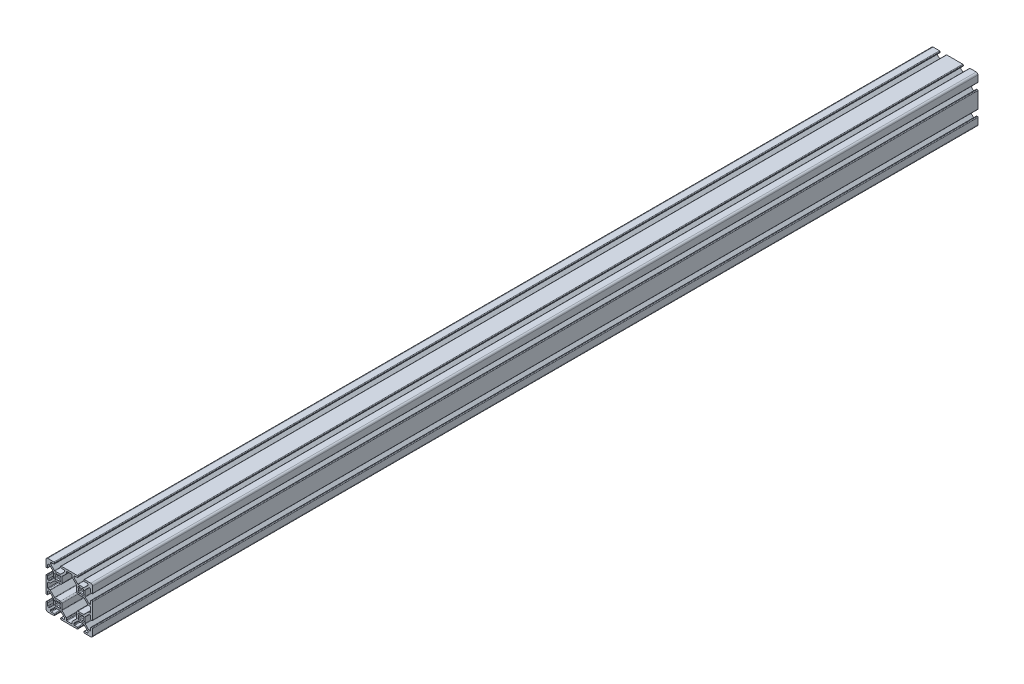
from build123d import *

# Parameters (mm, degrees)
EXTRUDE1_DEPTH = 762


with BuildPart() as part:
    # Sketch1 → Extrude1 (new body)
    with BuildSketch(Plane.XY):
        with BuildLine():
            Line((-36.908207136, -152.779600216), (-32.140368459, -152.779600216))
            ThreePointArc((-32.140368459, -152.779600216), (-31.945965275, -152.818269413), (-31.781158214, -152.928389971))
            Line((-31.781158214, -152.928389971), (-28.678077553, -156.031470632))
            ThreePointArc((-28.678077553, -156.031470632), (-28.567956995, -156.196277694), (-28.529287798, -156.390680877))
            Line((-28.529287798, -156.390680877), (-28.529287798, -157.116600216))
            ThreePointArc((-28.529287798, -157.116600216), (-28.678077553, -157.475810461), (-29.037287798, -157.624600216))
            Line((-29.037287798, -157.624600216), (-31.386287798, -157.624600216))
            ThreePointArc((-31.386287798, -157.624600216), (-31.745498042, -157.773389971), (-31.894287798, -158.132600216))
            Line((-31.894287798, -158.132600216), (-31.894287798, -158.616600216))
            ThreePointArc((-31.894287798, -158.616600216), (-31.745498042, -158.975810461), (-31.386287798, -159.124600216))
            Line((-31.386287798, -159.124600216), (-17.662287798, -159.124600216))
            ThreePointArc((-17.662287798, -159.124600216), (-17.303077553, -158.975810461), (-17.154287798, -158.616600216))
            Line((-17.154287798, -158.616600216), (-17.154287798, -158.132600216))
            ThreePointArc((-17.154287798, -158.132600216), (-17.303077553, -157.773389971), (-17.662287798, -157.624600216))
            Line((-17.662287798, -157.624600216), (-20.011287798, -157.624600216))
            ThreePointArc((-20.011287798, -157.624600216), (-20.370498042, -157.475810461), (-20.519287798, -157.116600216))
            Line((-20.519287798, -157.116600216), (-20.519287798, -156.390680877))
            ThreePointArc((-20.519287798, -156.390680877), (-20.4806186, -156.196277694), (-20.370498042, -156.031470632))
            Line((-20.370498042, -156.031470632), (-17.267417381, -152.928389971))
            ThreePointArc((-17.267417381, -152.928389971), (-17.10261032, -152.818269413), (-16.908207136, -152.779600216))
            Line((-16.908207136, -152.779600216), (-12.140368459, -152.779600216))
            ThreePointArc((-12.140368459, -152.779600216), (-11.945965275, -152.818269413), (-11.781158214, -152.928389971))
            Line((-11.781158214, -152.928389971), (-8.678077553, -156.031470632))
            ThreePointArc((-8.678077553, -156.031470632), (-8.567956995, -156.196277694), (-8.529287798, -156.390680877))
            Line((-8.529287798, -156.390680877), (-8.529287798, -157.116600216))
            ThreePointArc((-8.529287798, -157.116600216), (-8.678077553, -157.475810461), (-9.037287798, -157.624600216))
            Line((-9.037287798, -157.624600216), (-11.386287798, -157.624600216))
            ThreePointArc((-11.386287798, -157.624600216), (-11.745498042, -157.773389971), (-11.894287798, -158.132600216))
            Line((-11.894287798, -158.132600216), (-11.894287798, -158.616600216))
            ThreePointArc((-11.894287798, -158.616600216), (-11.745498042, -158.975810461), (-11.386287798, -159.124600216))
            Line((-11.386287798, -159.124600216), (-6.024287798, -159.124600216))
            ThreePointArc((-6.024287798, -159.124600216), (-4.963627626, -158.685260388), (-4.524287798, -157.624600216))
            Line((-4.524287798, -157.624600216), (-4.524287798, -152.262600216))
            ThreePointArc((-4.524287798, -152.262600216), (-4.673077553, -151.903389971), (-5.032287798, -151.754600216))
            Line((-5.032287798, -151.754600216), (-5.516287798, -151.754600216))
            ThreePointArc((-5.516287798, -151.754600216), (-5.875498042, -151.903389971), (-6.024287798, -152.262600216))
            Line((-6.024287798, -152.262600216), (-6.024287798, -154.611600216))
            ThreePointArc((-6.024287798, -154.611600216), (-6.173077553, -154.970810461), (-6.532287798, -155.119600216))
            Line((-6.532287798, -155.119600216), (-7.258207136, -155.119600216))
            ThreePointArc((-7.258207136, -155.119600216), (-7.45261032, -155.080931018), (-7.617417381, -154.970810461))
            Line((-7.617417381, -154.970810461), (-10.720498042, -151.867729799))
            ThreePointArc((-10.720498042, -151.867729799), (-10.8306186, -151.702922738), (-10.869287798, -151.508519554))
            Line((-10.869287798, -151.508519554), (-10.869287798, -146.740680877))
            ThreePointArc((-10.869287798, -146.740680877), (-10.8306186, -146.546277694), (-10.720498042, -146.381470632))
            Line((-10.720498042, -146.381470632), (-7.617417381, -143.278389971))
            ThreePointArc((-7.617417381, -143.278389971), (-7.45261032, -143.168269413), (-7.258207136, -143.129600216))
            Line((-7.258207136, -143.129600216), (-6.532287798, -143.129600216))
            ThreePointArc((-6.532287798, -143.129600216), (-6.173077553, -143.278389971), (-6.024287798, -143.637600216))
            Line((-6.024287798, -143.637600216), (-6.024287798, -145.986600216))
            ThreePointArc((-6.024287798, -145.986600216), (-5.875498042, -146.345810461), (-5.516287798, -146.494600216))
            Line((-5.516287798, -146.494600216), (-5.032287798, -146.494600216))
            ThreePointArc((-5.032287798, -146.494600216), (-4.673077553, -146.345810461), (-4.524287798, -145.986600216))
            Line((-4.524287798, -145.986600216), (-4.524287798, -132.262600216))
            ThreePointArc((-4.524287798, -132.262600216), (-4.673077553, -131.903389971), (-5.032287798, -131.754600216))
            Line((-5.032287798, -131.754600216), (-5.516287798, -131.754600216))
            ThreePointArc((-5.516287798, -131.754600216), (-5.875498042, -131.903389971), (-6.024287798, -132.262600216))
            Line((-6.024287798, -132.262600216), (-6.024287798, -134.611600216))
            ThreePointArc((-6.024287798, -134.611600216), (-6.173077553, -134.970810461), (-6.532287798, -135.119600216))
            Line((-6.532287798, -135.119600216), (-7.258207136, -135.119600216))
            ThreePointArc((-7.258207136, -135.119600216), (-7.45261032, -135.080931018), (-7.617417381, -134.970810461))
            Line((-7.617417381, -134.970810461), (-10.720498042, -131.867729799))
            ThreePointArc((-10.720498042, -131.867729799), (-10.8306186, -131.702922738), (-10.869287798, -131.508519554))
            Line((-10.869287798, -131.508519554), (-10.869287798, -126.740680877))
            ThreePointArc((-10.869287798, -126.740680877), (-10.8306186, -126.546277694), (-10.720498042, -126.381470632))
            Line((-10.720498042, -126.381470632), (-7.617417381, -123.278389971))
            ThreePointArc((-7.617417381, -123.278389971), (-7.45261032, -123.168269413), (-7.258207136, -123.129600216))
            Line((-7.258207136, -123.129600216), (-6.532287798, -123.129600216))
            ThreePointArc((-6.532287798, -123.129600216), (-6.173077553, -123.278389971), (-6.024287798, -123.637600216))
            Line((-6.024287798, -123.637600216), (-6.024287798, -125.986600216))
            ThreePointArc((-6.024287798, -125.986600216), (-5.875498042, -126.345810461), (-5.516287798, -126.494600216))
            Line((-5.516287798, -126.494600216), (-5.032287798, -126.494600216))
            ThreePointArc((-5.032287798, -126.494600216), (-4.673077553, -126.345810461), (-4.524287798, -125.986600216))
            Line((-4.524287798, -125.986600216), (-4.524287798, -120.624600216))
            ThreePointArc((-4.524287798, -120.624600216), (-4.963627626, -119.563940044), (-6.024287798, -119.124600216))
            Line((-6.024287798, -119.124600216), (-11.386287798, -119.124600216))
            ThreePointArc((-11.386287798, -119.124600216), (-11.745498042, -119.273389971), (-11.894287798, -119.632600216))
            Line((-11.894287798, -119.632600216), (-11.894287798, -120.116600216))
            ThreePointArc((-11.894287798, -120.116600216), (-11.745498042, -120.475810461), (-11.386287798, -120.624600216))
            Line((-11.386287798, -120.624600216), (-9.037287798, -120.624600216))
            ThreePointArc((-9.037287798, -120.624600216), (-8.678077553, -120.773389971), (-8.529287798, -121.132600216))
            Line((-8.529287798, -121.132600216), (-8.529287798, -121.858519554))
            ThreePointArc((-8.529287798, -121.858519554), (-8.567956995, -122.052922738), (-8.678077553, -122.217729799))
            Line((-8.678077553, -122.217729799), (-11.781158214, -125.320810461))
            ThreePointArc((-11.781158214, -125.320810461), (-11.945965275, -125.430931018), (-12.140368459, -125.469600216))
            Line((-12.140368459, -125.469600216), (-16.908207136, -125.469600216))
            ThreePointArc((-16.908207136, -125.469600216), (-17.10261032, -125.430931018), (-17.267417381, -125.320810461))
            Line((-17.267417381, -125.320810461), (-20.370498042, -122.217729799))
            ThreePointArc((-20.370498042, -122.217729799), (-20.4806186, -122.052922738), (-20.519287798, -121.858519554))
            Line((-20.519287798, -121.858519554), (-20.519287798, -121.132600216))
            ThreePointArc((-20.519287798, -121.132600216), (-20.370498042, -120.773389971), (-20.011287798, -120.624600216))
            Line((-20.011287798, -120.624600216), (-17.662287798, -120.624600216))
            ThreePointArc((-17.662287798, -120.624600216), (-17.303077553, -120.475810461), (-17.154287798, -120.116600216))
            Line((-17.154287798, -120.116600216), (-17.154287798, -119.632600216))
            ThreePointArc((-17.154287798, -119.632600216), (-17.303077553, -119.273389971), (-17.662287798, -119.124600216))
            Line((-17.662287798, -119.124600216), (-31.386287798, -119.124600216))
            ThreePointArc((-31.386287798, -119.124600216), (-31.745498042, -119.273389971), (-31.894287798, -119.632600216))
            Line((-31.894287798, -119.632600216), (-31.894287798, -120.116600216))
            ThreePointArc((-31.894287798, -120.116600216), (-31.745498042, -120.475810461), (-31.386287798, -120.624600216))
            Line((-31.386287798, -120.624600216), (-29.037287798, -120.624600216))
            ThreePointArc((-29.037287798, -120.624600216), (-28.678077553, -120.773389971), (-28.529287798, -121.132600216))
            Line((-28.529287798, -121.132600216), (-28.529287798, -121.858519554))
            ThreePointArc((-28.529287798, -121.858519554), (-28.567956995, -122.052922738), (-28.678077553, -122.217729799))
            Line((-28.678077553, -122.217729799), (-31.781158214, -125.320810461))
            ThreePointArc((-31.781158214, -125.320810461), (-31.945965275, -125.430931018), (-32.140368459, -125.469600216))
            Line((-32.140368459, -125.469600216), (-36.908207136, -125.469600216))
            ThreePointArc((-36.908207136, -125.469600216), (-37.10261032, -125.430931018), (-37.267417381, -125.320810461))
            Line((-37.267417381, -125.320810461), (-40.370498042, -122.217729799))
            ThreePointArc((-40.370498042, -122.217729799), (-40.4806186, -122.052922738), (-40.519287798, -121.858519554))
            Line((-40.519287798, -121.858519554), (-40.519287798, -121.132600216))
            ThreePointArc((-40.519287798, -121.132600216), (-40.370498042, -120.773389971), (-40.011287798, -120.624600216))
            Line((-40.011287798, -120.624600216), (-37.662287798, -120.624600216))
            ThreePointArc((-37.662287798, -120.624600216), (-37.303077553, -120.475810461), (-37.154287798, -120.116600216))
            Line((-37.154287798, -120.116600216), (-37.154287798, -119.632600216))
            ThreePointArc((-37.154287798, -119.632600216), (-37.303077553, -119.273389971), (-37.662287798, -119.124600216))
            Line((-37.662287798, -119.124600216), (-43.024287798, -119.124600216))
            ThreePointArc((-43.024287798, -119.124600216), (-44.084947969, -119.563940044), (-44.524287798, -120.624600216))
            Line((-44.524287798, -120.624600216), (-44.524287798, -125.986600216))
            ThreePointArc((-44.524287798, -125.986600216), (-44.375498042, -126.345810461), (-44.016287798, -126.494600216))
            Line((-44.016287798, -126.494600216), (-43.532287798, -126.494600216))
            ThreePointArc((-43.532287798, -126.494600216), (-43.173077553, -126.345810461), (-43.024287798, -125.986600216))
            Line((-43.024287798, -125.986600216), (-43.024287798, -123.637600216))
            ThreePointArc((-43.024287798, -123.637600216), (-42.875498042, -123.278389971), (-42.516287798, -123.129600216))
            Line((-42.516287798, -123.129600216), (-41.790368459, -123.129600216))
            ThreePointArc((-41.790368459, -123.129600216), (-41.595965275, -123.168269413), (-41.431158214, -123.278389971))
            Line((-41.431158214, -123.278389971), (-38.328077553, -126.381470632))
            ThreePointArc((-38.328077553, -126.381470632), (-38.217956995, -126.546277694), (-38.179287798, -126.740680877))
            Line((-38.179287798, -126.740680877), (-38.179287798, -131.508519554))
            ThreePointArc((-38.179287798, -131.508519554), (-38.217956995, -131.702922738), (-38.328077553, -131.867729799))
            Line((-38.328077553, -131.867729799), (-41.431158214, -134.970810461))
            ThreePointArc((-41.431158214, -134.970810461), (-41.595965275, -135.080931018), (-41.790368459, -135.119600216))
            Line((-41.790368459, -135.119600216), (-42.516287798, -135.119600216))
            ThreePointArc((-42.516287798, -135.119600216), (-42.875498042, -134.970810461), (-43.024287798, -134.611600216))
            Line((-43.024287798, -134.611600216), (-43.024287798, -132.262600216))
            ThreePointArc((-43.024287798, -132.262600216), (-43.173077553, -131.903389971), (-43.532287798, -131.754600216))
            Line((-43.532287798, -131.754600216), (-44.016287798, -131.754600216))
            ThreePointArc((-44.016287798, -131.754600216), (-44.375498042, -131.903389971), (-44.524287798, -132.262600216))
            Line((-44.524287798, -132.262600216), (-44.524287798, -145.986600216))
            ThreePointArc((-44.524287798, -145.986600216), (-44.375498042, -146.345810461), (-44.016287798, -146.494600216))
            Line((-44.016287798, -146.494600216), (-43.532287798, -146.494600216))
            ThreePointArc((-43.532287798, -146.494600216), (-43.173077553, -146.345810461), (-43.024287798, -145.986600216))
            Line((-43.024287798, -145.986600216), (-43.024287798, -143.637600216))
            ThreePointArc((-43.024287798, -143.637600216), (-42.875498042, -143.278389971), (-42.516287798, -143.129600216))
            Line((-42.516287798, -143.129600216), (-41.790368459, -143.129600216))
            ThreePointArc((-41.790368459, -143.129600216), (-41.595965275, -143.168269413), (-41.431158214, -143.278389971))
            Line((-41.431158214, -143.278389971), (-38.328077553, -146.381470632))
            ThreePointArc((-38.328077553, -146.381470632), (-38.217956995, -146.546277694), (-38.179287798, -146.740680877))
            Line((-38.179287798, -146.740680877), (-38.179287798, -151.508519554))
            ThreePointArc((-38.179287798, -151.508519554), (-38.217956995, -151.702922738), (-38.328077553, -151.867729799))
            Line((-38.328077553, -151.867729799), (-41.431158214, -154.970810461))
            ThreePointArc((-41.431158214, -154.970810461), (-41.595965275, -155.080931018), (-41.790368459, -155.119600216))
            Line((-41.790368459, -155.119600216), (-42.516287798, -155.119600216))
            ThreePointArc((-42.516287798, -155.119600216), (-42.875498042, -154.970810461), (-43.024287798, -154.611600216))
            Line((-43.024287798, -154.611600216), (-43.024287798, -152.262600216))
            ThreePointArc((-43.024287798, -152.262600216), (-43.173077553, -151.903389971), (-43.532287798, -151.754600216))
            Line((-43.532287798, -151.754600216), (-44.016287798, -151.754600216))
            ThreePointArc((-44.016287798, -151.754600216), (-44.375498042, -151.903389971), (-44.524287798, -152.262600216))
            Line((-44.524287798, -152.262600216), (-44.524287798, -157.624600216))
            ThreePointArc((-44.524287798, -157.624600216), (-44.084947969, -158.685260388), (-43.024287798, -159.124600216))
            Line((-43.024287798, -159.124600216), (-37.662287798, -159.124600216))
            ThreePointArc((-37.662287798, -159.124600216), (-37.303077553, -158.975810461), (-37.154287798, -158.616600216))
            Line((-37.154287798, -158.616600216), (-37.154287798, -158.132600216))
            ThreePointArc((-37.154287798, -158.132600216), (-37.303077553, -157.773389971), (-37.662287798, -157.624600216))
            Line((-37.662287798, -157.624600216), (-40.011287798, -157.624600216))
            ThreePointArc((-40.011287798, -157.624600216), (-40.370498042, -157.475810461), (-40.519287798, -157.116600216))
            Line((-40.519287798, -157.116600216), (-40.519287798, -156.390680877))
            ThreePointArc((-40.519287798, -156.390680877), (-40.4806186, -156.196277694), (-40.370498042, -156.031470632))
            Line((-40.370498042, -156.031470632), (-37.267417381, -152.928389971))
            ThreePointArc((-37.267417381, -152.928389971), (-37.10261032, -152.818269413), (-36.908207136, -152.779600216))
        make_face()
        with BuildLine():
            Line((-16.649188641, -131.429106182), (-16.828793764, -131.249501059))
            ThreePointArc((-16.828793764, -131.249501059), (-17.030225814, -130.481068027), (-16.459421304, -129.928576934))
            ThreePointArc((-16.459421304, -129.928576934), (-16.619787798, -129.124600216), (-16.459421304, -128.320623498))
            ThreePointArc((-16.459421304, -128.320623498), (-17.030225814, -127.768132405), (-16.828793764, -126.999699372))
            Line((-16.828793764, -126.999699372), (-16.649188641, -126.82009425))
            ThreePointArc((-16.649188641, -126.82009425), (-15.880755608, -126.618662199), (-15.328264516, -127.18946671))
            ThreePointArc((-15.328264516, -127.18946671), (-14.524287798, -127.029100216), (-13.72031108, -127.18946671))
            ThreePointArc((-13.72031108, -127.18946671), (-13.167819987, -126.618662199), (-12.399386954, -126.82009425))
            Line((-12.399386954, -126.82009425), (-12.219781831, -126.999699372))
            ThreePointArc((-12.219781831, -126.999699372), (-12.018349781, -127.768132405), (-12.589154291, -128.320623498))
            ThreePointArc((-12.589154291, -128.320623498), (-12.428787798, -129.124600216), (-12.589154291, -129.928576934))
            ThreePointArc((-12.589154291, -129.928576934), (-12.018349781, -130.481068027), (-12.219781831, -131.249501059))
            Line((-12.219781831, -131.249501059), (-12.399386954, -131.429106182))
            ThreePointArc((-12.399386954, -131.429106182), (-13.167819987, -131.630538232), (-13.72031108, -131.059733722))
            ThreePointArc((-13.72031108, -131.059733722), (-14.524287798, -131.220100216), (-15.328264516, -131.059733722))
            ThreePointArc((-15.328264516, -131.059733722), (-15.880755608, -131.630538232), (-16.649188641, -131.429106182))
        make_face(mode=Mode.SUBTRACT)
        with BuildLine():
            Line((-36.649188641, -131.429106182), (-36.828793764, -131.249501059))
            ThreePointArc((-36.828793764, -131.249501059), (-37.030225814, -130.481068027), (-36.459421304, -129.928576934))
            ThreePointArc((-36.459421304, -129.928576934), (-36.619787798, -129.124600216), (-36.459421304, -128.320623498))
            ThreePointArc((-36.459421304, -128.320623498), (-37.030225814, -127.768132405), (-36.828793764, -126.999699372))
            Line((-36.828793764, -126.999699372), (-36.649188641, -126.82009425))
            ThreePointArc((-36.649188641, -126.82009425), (-35.880755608, -126.618662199), (-35.328264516, -127.18946671))
            ThreePointArc((-35.328264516, -127.18946671), (-34.524287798, -127.029100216), (-33.72031108, -127.18946671))
            ThreePointArc((-33.72031108, -127.18946671), (-33.167819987, -126.618662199), (-32.399386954, -126.82009425))
            Line((-32.399386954, -126.82009425), (-32.219781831, -126.999699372))
            ThreePointArc((-32.219781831, -126.999699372), (-32.018349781, -127.768132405), (-32.589154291, -128.320623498))
            ThreePointArc((-32.589154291, -128.320623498), (-32.428787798, -129.124600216), (-32.589154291, -129.928576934))
            ThreePointArc((-32.589154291, -129.928576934), (-32.018349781, -130.481068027), (-32.219781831, -131.249501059))
            Line((-32.219781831, -131.249501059), (-32.399386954, -131.429106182))
            ThreePointArc((-32.399386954, -131.429106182), (-33.167819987, -131.630538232), (-33.72031108, -131.059733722))
            ThreePointArc((-33.72031108, -131.059733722), (-34.524287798, -131.220100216), (-35.328264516, -131.059733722))
            ThreePointArc((-35.328264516, -131.059733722), (-35.880755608, -131.630538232), (-36.649188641, -131.429106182))
        make_face(mode=Mode.SUBTRACT)
        with BuildLine():
            Line((-16.649188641, -151.429106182), (-16.828793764, -151.249501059))
            ThreePointArc((-16.828793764, -151.249501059), (-17.030225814, -150.481068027), (-16.459421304, -149.928576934))
            ThreePointArc((-16.459421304, -149.928576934), (-16.619787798, -149.124600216), (-16.459421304, -148.320623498))
            ThreePointArc((-16.459421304, -148.320623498), (-17.030225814, -147.768132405), (-16.828793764, -146.999699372))
            Line((-16.828793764, -146.999699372), (-16.649188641, -146.82009425))
            ThreePointArc((-16.649188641, -146.82009425), (-15.880755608, -146.618662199), (-15.328264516, -147.18946671))
            ThreePointArc((-15.328264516, -147.18946671), (-14.524287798, -147.029100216), (-13.72031108, -147.18946671))
            ThreePointArc((-13.72031108, -147.18946671), (-13.167819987, -146.618662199), (-12.399386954, -146.82009425))
            Line((-12.399386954, -146.82009425), (-12.219781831, -146.999699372))
            ThreePointArc((-12.219781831, -146.999699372), (-12.018349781, -147.768132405), (-12.589154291, -148.320623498))
            ThreePointArc((-12.589154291, -148.320623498), (-12.428787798, -149.124600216), (-12.589154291, -149.928576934))
            ThreePointArc((-12.589154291, -149.928576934), (-12.018349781, -150.481068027), (-12.219781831, -151.249501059))
            Line((-12.219781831, -151.249501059), (-12.399386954, -151.429106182))
            ThreePointArc((-12.399386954, -151.429106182), (-13.167819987, -151.630538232), (-13.72031108, -151.059733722))
            ThreePointArc((-13.72031108, -151.059733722), (-14.524287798, -151.220100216), (-15.328264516, -151.059733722))
            ThreePointArc((-15.328264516, -151.059733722), (-15.880755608, -151.630538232), (-16.649188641, -151.429106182))
        make_face(mode=Mode.SUBTRACT)
        with BuildLine():
            Line((-27.029287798, -157.116600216), (-27.029287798, -155.769360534))
            ThreePointArc((-27.029287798, -155.769360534), (-27.067956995, -155.57495735), (-27.178077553, -155.410150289))
            Line((-27.178077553, -155.410150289), (-30.720498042, -151.867729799))
            ThreePointArc((-30.720498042, -151.867729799), (-30.8306186, -151.702922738), (-30.869287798, -151.508519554))
            Line((-30.869287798, -151.508519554), (-30.869287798, -146.612600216))
            ThreePointArc((-30.869287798, -146.612600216), (-31.204064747, -145.804377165), (-32.012287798, -145.469600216))
            Line((-32.012287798, -145.469600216), (-36.908207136, -145.469600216))
            ThreePointArc((-36.908207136, -145.469600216), (-37.10261032, -145.430931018), (-37.267417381, -145.320810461))
            Line((-37.267417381, -145.320810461), (-40.809837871, -141.778389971))
            ThreePointArc((-40.809837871, -141.778389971), (-40.974644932, -141.668269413), (-41.169048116, -141.629600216))
            Line((-41.169048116, -141.629600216), (-42.516287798, -141.629600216))
            ThreePointArc((-42.516287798, -141.629600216), (-42.875498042, -141.480810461), (-43.024287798, -141.121600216))
            Line((-43.024287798, -141.121600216), (-43.024287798, -137.127600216))
            ThreePointArc((-43.024287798, -137.127600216), (-42.875498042, -136.768389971), (-42.516287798, -136.619600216))
            Line((-42.516287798, -136.619600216), (-41.169048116, -136.619600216))
            ThreePointArc((-41.169048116, -136.619600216), (-40.974644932, -136.580931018), (-40.809837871, -136.470810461))
            Line((-40.809837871, -136.470810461), (-37.267417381, -132.928389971))
            ThreePointArc((-37.267417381, -132.928389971), (-37.10261032, -132.818269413), (-36.908207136, -132.779600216))
            Line((-36.908207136, -132.779600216), (-32.012287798, -132.779600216))
            ThreePointArc((-32.012287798, -132.779600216), (-31.204064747, -132.444823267), (-30.869287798, -131.636600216))
            Line((-30.869287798, -131.636600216), (-30.869287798, -126.740680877))
            ThreePointArc((-30.869287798, -126.740680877), (-30.8306186, -126.546277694), (-30.720498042, -126.381470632))
            Line((-30.720498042, -126.381470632), (-27.178077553, -122.839050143))
            ThreePointArc((-27.178077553, -122.839050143), (-27.067956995, -122.674243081), (-27.029287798, -122.479839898))
            Line((-27.029287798, -122.479839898), (-27.029287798, -121.132600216))
            ThreePointArc((-27.029287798, -121.132600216), (-26.880498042, -120.773389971), (-26.521287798, -120.624600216))
            Line((-26.521287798, -120.624600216), (-22.527287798, -120.624600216))
            ThreePointArc((-22.527287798, -120.624600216), (-22.168077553, -120.773389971), (-22.019287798, -121.132600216))
            Line((-22.019287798, -121.132600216), (-22.019287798, -122.479839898))
            ThreePointArc((-22.019287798, -122.479839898), (-21.9806186, -122.674243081), (-21.870498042, -122.839050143))
            Line((-21.870498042, -122.839050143), (-18.328077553, -126.381470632))
            ThreePointArc((-18.328077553, -126.381470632), (-18.217956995, -126.546277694), (-18.179287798, -126.740680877))
            Line((-18.179287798, -126.740680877), (-18.179287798, -131.636600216))
            ThreePointArc((-18.179287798, -131.636600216), (-17.844510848, -132.444823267), (-17.036287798, -132.779600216))
            Line((-17.036287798, -132.779600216), (-12.140368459, -132.779600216))
            ThreePointArc((-12.140368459, -132.779600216), (-11.945965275, -132.818269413), (-11.781158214, -132.928389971))
            Line((-11.781158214, -132.928389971), (-8.238737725, -136.470810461))
            ThreePointArc((-8.238737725, -136.470810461), (-8.073930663, -136.580931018), (-7.87952748, -136.619600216))
            Line((-7.87952748, -136.619600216), (-6.532287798, -136.619600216))
            ThreePointArc((-6.532287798, -136.619600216), (-6.173077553, -136.768389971), (-6.024287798, -137.127600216))
            Line((-6.024287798, -137.127600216), (-6.024287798, -141.121600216))
            ThreePointArc((-6.024287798, -141.121600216), (-6.173077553, -141.480810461), (-6.532287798, -141.629600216))
            Line((-6.532287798, -141.629600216), (-7.87952748, -141.629600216))
            ThreePointArc((-7.87952748, -141.629600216), (-8.073930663, -141.668269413), (-8.238737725, -141.778389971))
            Line((-8.238737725, -141.778389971), (-11.781158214, -145.320810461))
            ThreePointArc((-11.781158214, -145.320810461), (-11.945965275, -145.430931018), (-12.140368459, -145.469600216))
            Line((-12.140368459, -145.469600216), (-17.036287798, -145.469600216))
            ThreePointArc((-17.036287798, -145.469600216), (-17.844510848, -145.804377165), (-18.179287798, -146.612600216))
            Line((-18.179287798, -146.612600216), (-18.179287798, -151.508519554))
            ThreePointArc((-18.179287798, -151.508519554), (-18.217956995, -151.702922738), (-18.328077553, -151.867729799))
            Line((-18.328077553, -151.867729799), (-21.870498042, -155.410150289))
            ThreePointArc((-21.870498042, -155.410150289), (-21.9806186, -155.57495735), (-22.019287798, -155.769360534))
            Line((-22.019287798, -155.769360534), (-22.019287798, -157.116600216))
            ThreePointArc((-22.019287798, -157.116600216), (-22.168077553, -157.475810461), (-22.527287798, -157.624600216))
            Line((-22.527287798, -157.624600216), (-26.521287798, -157.624600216))
            ThreePointArc((-26.521287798, -157.624600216), (-26.880498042, -157.475810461), (-27.029287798, -157.116600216))
        make_face(mode=Mode.SUBTRACT)
        with BuildLine():
            Line((-36.649188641, -151.429106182), (-36.828793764, -151.249501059))
            ThreePointArc((-36.828793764, -151.249501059), (-37.030225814, -150.481068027), (-36.459421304, -149.928576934))
            ThreePointArc((-36.459421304, -149.928576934), (-36.619787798, -149.124600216), (-36.459421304, -148.320623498))
            ThreePointArc((-36.459421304, -148.320623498), (-37.030225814, -147.768132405), (-36.828793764, -146.999699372))
            Line((-36.828793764, -146.999699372), (-36.649188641, -146.82009425))
            ThreePointArc((-36.649188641, -146.82009425), (-35.880755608, -146.618662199), (-35.328264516, -147.18946671))
            ThreePointArc((-35.328264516, -147.18946671), (-34.524287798, -147.029100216), (-33.72031108, -147.18946671))
            ThreePointArc((-33.72031108, -147.18946671), (-33.167819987, -146.618662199), (-32.399386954, -146.82009425))
            Line((-32.399386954, -146.82009425), (-32.219781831, -146.999699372))
            ThreePointArc((-32.219781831, -146.999699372), (-32.018349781, -147.768132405), (-32.589154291, -148.320623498))
            ThreePointArc((-32.589154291, -148.320623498), (-32.428787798, -149.124600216), (-32.589154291, -149.928576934))
            ThreePointArc((-32.589154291, -149.928576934), (-32.018349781, -150.481068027), (-32.219781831, -151.249501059))
            Line((-32.219781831, -151.249501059), (-32.399386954, -151.429106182))
            ThreePointArc((-32.399386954, -151.429106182), (-33.167819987, -151.630538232), (-33.72031108, -151.059733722))
            ThreePointArc((-33.72031108, -151.059733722), (-34.524287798, -151.220100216), (-35.328264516, -151.059733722))
            ThreePointArc((-35.328264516, -151.059733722), (-35.880755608, -151.630538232), (-36.649188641, -151.429106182))
        make_face(mode=Mode.SUBTRACT)
    extrude(amount=EXTRUDE1_DEPTH)


solid = part.part
